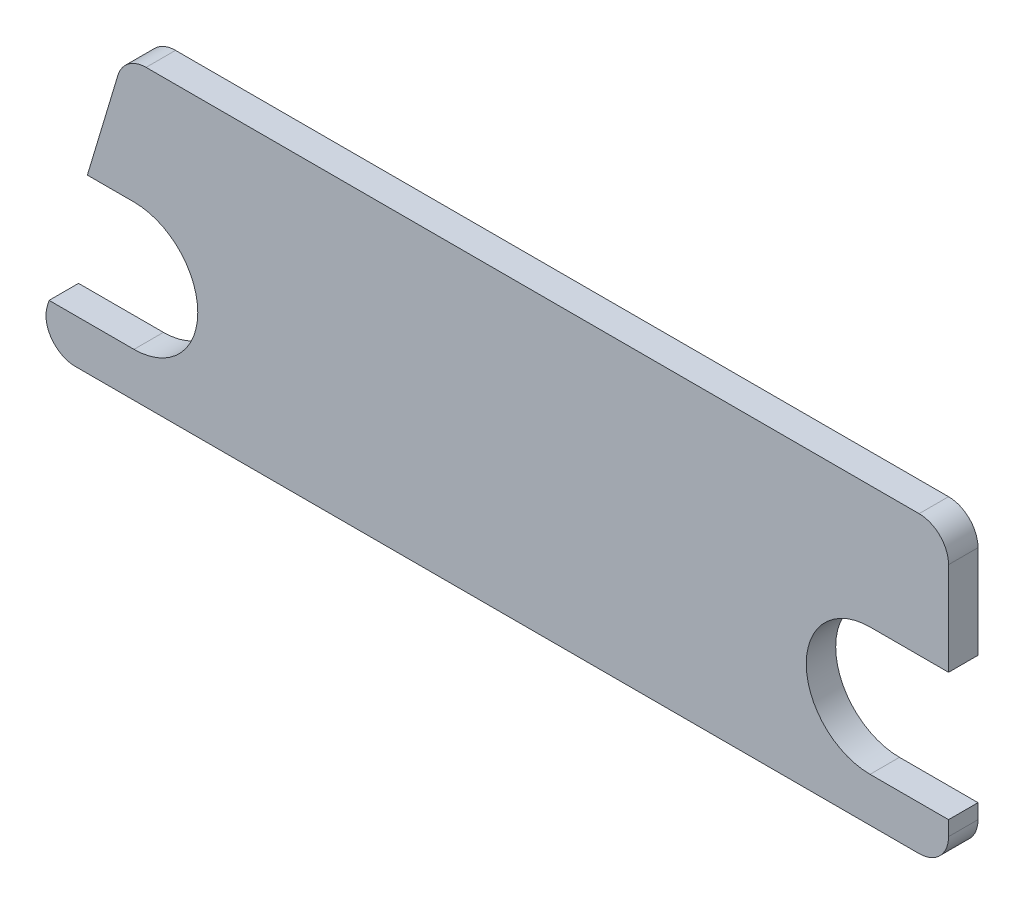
from build123d import *

# Parameters (mm, degrees)
BASE_EXTRUSION_DEPTH = 3


with BuildPart() as part:
    # Esquisse1 → Base-Extrusion (new body)
    with BuildSketch(Plane.XY):
        with BuildLine():
            Line((-84.641386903, 27.862043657), (-87.75, 17.5))
            Line((-87.75, 17.5), (-83, 17.5))
            ThreePointArc((-83, 17.5), (-76.5, 11), (-83, 4.5))
            Line((-83, 4.5), (-91.65, 4.5))
            Line((-91.65, 4.5), (-91.841386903, 3.862043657))
            ThreePointArc((-91.841386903, 3.862043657), (-91.374786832, 1.209208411), (-88.967908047, 0))
            Line((-88.967908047, 0), (-3, 0))
            ThreePointArc((-3, 0), (-0.878679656, 0.878679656), (0, 3))
            Line((0, 3), (0, 4.5))
            Line((0, 4.5), (-8, 4.5))
            ThreePointArc((-8, 4.5), (-14.5, 11), (-8, 17.5))
            Line((-8, 17.5), (0, 17.5))
            Line((0, 17.5), (0, 27))
            ThreePointArc((0, 27), (-0.878679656, 29.121320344), (-3, 30))
            Line((-3, 30), (-81.767908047, 30))
            ThreePointArc((-81.767908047, 30), (-83.558699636, 29.406878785), (-84.641386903, 27.862043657))
        make_face()
    extrude(amount=BASE_EXTRUSION_DEPTH)


solid = part.part
